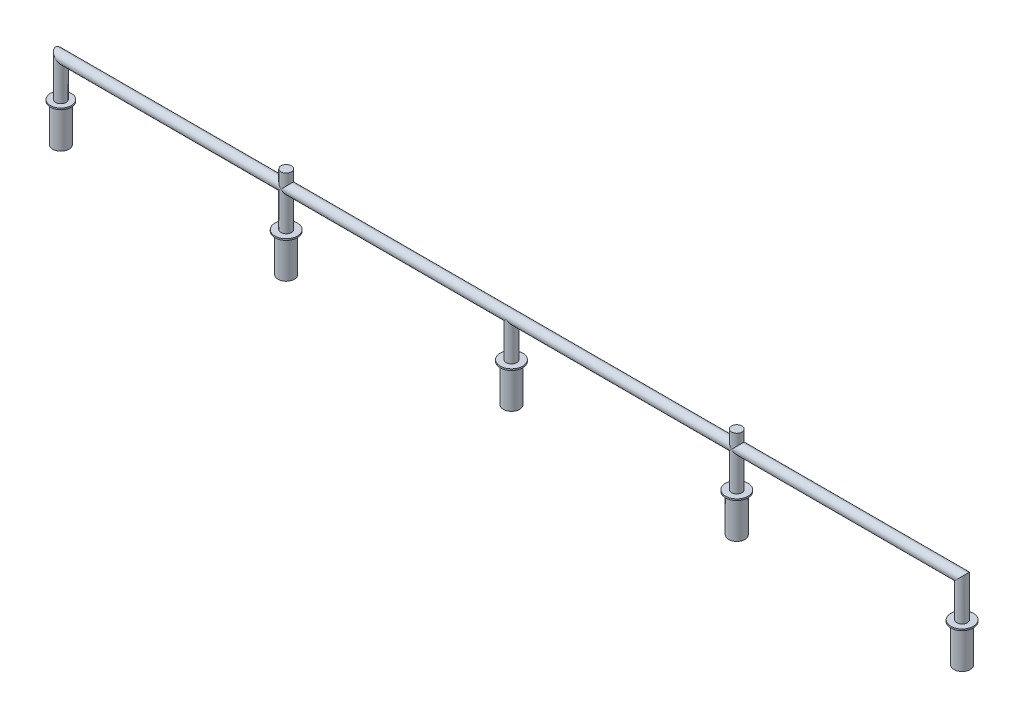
ISO-10303-21;
HEADER;
FILE_DESCRIPTION(('STEP AP214'),'2;1');
FILE_NAME('part.step','',(''),(''),'','','');
FILE_SCHEMA(('AUTOMOTIVE_DESIGN { 1 0 10303 214 1 1 1 1 }'));
ENDSEC;
DATA;
#1=APPLICATION_CONTEXT('core data for automotive mechanical design processes');
#2=APPLICATION_PROTOCOL_DEFINITION('international standard','automotive_design',2000,#1);
#3=PRODUCT_CONTEXT('',#1,'mechanical');
#4=PRODUCT('Part','Part','',(#3));
#5=PRODUCT_RELATED_PRODUCT_CATEGORY('part','',(#4));
#6=PRODUCT_DEFINITION_FORMATION('','',#4);
#7=PRODUCT_DEFINITION_CONTEXT('part definition',#1,'design');
#8=PRODUCT_DEFINITION('design','',#6,#7);
#9=PRODUCT_DEFINITION_SHAPE('','',#8);
#10=(LENGTH_UNIT() NAMED_UNIT(*) SI_UNIT(.MILLI.,.METRE.));
#11=(NAMED_UNIT(*) PLANE_ANGLE_UNIT() SI_UNIT($,.RADIAN.));
#12=(NAMED_UNIT(*) SI_UNIT($,.STERADIAN.) SOLID_ANGLE_UNIT());
#13=UNCERTAINTY_MEASURE_WITH_UNIT(LENGTH_MEASURE(1.E-05),#10,'distance_accuracy_value','');
#14=(GEOMETRIC_REPRESENTATION_CONTEXT(3) GLOBAL_UNCERTAINTY_ASSIGNED_CONTEXT((#13)) GLOBAL_UNIT_ASSIGNED_CONTEXT((#10,
#11,#12)) REPRESENTATION_CONTEXT('',''));
#15=CARTESIAN_POINT('',(0.,0.,0.));
#16=DIRECTION('',(0.,0.,1.));
#17=DIRECTION('',(1.,0.,0.));
#18=AXIS2_PLACEMENT_3D('',#15,#16,#17);
#19=CARTESIAN_POINT('',(600.,-102.,0.));
#20=DIRECTION('',(0.,1.,0.));
#21=DIRECTION('',(-1.,0.,0.));
#22=AXIS2_PLACEMENT_3D('',#19,#20,#21);
#23=CYLINDRICAL_SURFACE('',#22,10.8625225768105);
#24=CARTESIAN_POINT('',(600.,-102.,0.));
#25=DIRECTION('',(0.,-1.,0.));
#26=DIRECTION('',(1.,0.,0.));
#27=AXIS2_PLACEMENT_3D('',#24,#25,#26);
#28=CIRCLE('',#27,10.8625225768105);
#29=CARTESIAN_POINT('',(610.862522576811,-102.,0.));
#30=VERTEX_POINT('',#29);
#31=EDGE_CURVE('E12',#30,#30,#28,.T.);
#32=ORIENTED_EDGE('',*,*,#31,.F.);
#33=EDGE_LOOP('',(#32));
#34=FACE_BOUND('',#33,.T.);
#35=CARTESIAN_POINT('',(600.,-52.,0.));
#36=DIRECTION('',(0.,-1.,0.));
#37=DIRECTION('',(1.,0.,0.));
#38=AXIS2_PLACEMENT_3D('',#35,#36,#37);
#39=CIRCLE('',#38,10.8625225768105);
#40=CARTESIAN_POINT('',(610.862522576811,-52.,0.));
#41=VERTEX_POINT('',#40);
#42=EDGE_CURVE('E79',#41,#41,#39,.T.);
#43=ORIENTED_EDGE('',*,*,#42,.T.);
#44=EDGE_LOOP('',(#43));
#45=FACE_BOUND('',#44,.T.);
#46=ADVANCED_FACE('F76',(#34,#45),#23,.T.);
#47=CARTESIAN_POINT('',(600.,-102.,0.));
#48=DIRECTION('',(0.,-1.,0.));
#49=DIRECTION('',(1.,0.,0.));
#50=AXIS2_PLACEMENT_3D('',#47,#48,#49);
#51=PLANE('',#50);
#52=ORIENTED_EDGE('',*,*,#31,.T.);
#53=EDGE_LOOP('',(#52));
#54=FACE_BOUND('',#53,.T.);
#55=ADVANCED_FACE('F91',(#54),#51,.T.);
#56=CARTESIAN_POINT('',(600.,-52.,0.));
#57=DIRECTION('',(0.,-1.,0.));
#58=DIRECTION('',(1.,0.,0.));
#59=AXIS2_PLACEMENT_3D('',#56,#57,#58);
#60=PLANE('',#59);
#61=ORIENTED_EDGE('',*,*,#42,.F.);
#62=EDGE_LOOP('',(#61));
#63=FACE_BOUND('',#62,.T.);
#64=ADVANCED_FACE('F89',(#63),#60,.F.);
#65=CLOSED_SHELL('',(#46,#55,#64));
#66=MANIFOLD_SOLID_BREP('B2',#65);
#67=CARTESIAN_POINT('',(300.,-102.,0.));
#68=DIRECTION('',(0.,1.,0.));
#69=DIRECTION('',(-1.,0.,0.));
#70=AXIS2_PLACEMENT_3D('',#67,#68,#69);
#71=CYLINDRICAL_SURFACE('',#70,10.8625225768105);
#72=CARTESIAN_POINT('',(300.,-102.,0.));
#73=DIRECTION('',(0.,-1.,0.));
#74=DIRECTION('',(1.,0.,0.));
#75=AXIS2_PLACEMENT_3D('',#72,#73,#74);
#76=CIRCLE('',#75,10.8625225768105);
#77=CARTESIAN_POINT('',(310.862522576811,-102.,0.));
#78=VERTEX_POINT('',#77);
#79=EDGE_CURVE('E75',#78,#78,#76,.T.);
#80=ORIENTED_EDGE('',*,*,#79,.F.);
#81=EDGE_LOOP('',(#80));
#82=FACE_BOUND('',#81,.T.);
#83=CARTESIAN_POINT('',(300.,-52.,0.));
#84=DIRECTION('',(0.,-1.,0.));
#85=DIRECTION('',(1.,0.,0.));
#86=AXIS2_PLACEMENT_3D('',#83,#84,#85);
#87=CIRCLE('',#86,10.8625225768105);
#88=CARTESIAN_POINT('',(310.862522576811,-52.,0.));
#89=VERTEX_POINT('',#88);
#90=EDGE_CURVE('E128',#89,#89,#87,.T.);
#91=ORIENTED_EDGE('',*,*,#90,.T.);
#92=EDGE_LOOP('',(#91));
#93=FACE_BOUND('',#92,.T.);
#94=ADVANCED_FACE('F125',(#82,#93),#71,.T.);
#95=CARTESIAN_POINT('',(300.,-102.,0.));
#96=DIRECTION('',(0.,-1.,0.));
#97=DIRECTION('',(1.,0.,0.));
#98=AXIS2_PLACEMENT_3D('',#95,#96,#97);
#99=PLANE('',#98);
#100=ORIENTED_EDGE('',*,*,#79,.T.);
#101=EDGE_LOOP('',(#100));
#102=FACE_BOUND('',#101,.T.);
#103=ADVANCED_FACE('F140',(#102),#99,.T.);
#104=CARTESIAN_POINT('',(300.,-52.,0.));
#105=DIRECTION('',(0.,-1.,0.));
#106=DIRECTION('',(1.,0.,0.));
#107=AXIS2_PLACEMENT_3D('',#104,#105,#106);
#108=PLANE('',#107);
#109=ORIENTED_EDGE('',*,*,#90,.F.);
#110=EDGE_LOOP('',(#109));
#111=FACE_BOUND('',#110,.T.);
#112=ADVANCED_FACE('F138',(#111),#108,.F.);
#113=CLOSED_SHELL('',(#94,#103,#112));
#114=MANIFOLD_SOLID_BREP('B7',#113);
#115=CARTESIAN_POINT('',(1.11022302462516E-13,-102.,0.));
#116=DIRECTION('',(0.,1.,0.));
#117=DIRECTION('',(-1.,0.,0.));
#118=AXIS2_PLACEMENT_3D('',#115,#116,#117);
#119=CYLINDRICAL_SURFACE('',#118,10.8625225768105);
#120=CARTESIAN_POINT('',(1.11022302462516E-13,-102.,0.));
#121=DIRECTION('',(0.,-1.,0.));
#122=DIRECTION('',(1.,0.,0.));
#123=AXIS2_PLACEMENT_3D('',#120,#121,#122);
#124=CIRCLE('',#123,10.8625225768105);
#125=CARTESIAN_POINT('',(10.8625225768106,-102.,0.));
#126=VERTEX_POINT('',#125);
#127=EDGE_CURVE('E124',#126,#126,#124,.T.);
#128=ORIENTED_EDGE('',*,*,#127,.F.);
#129=EDGE_LOOP('',(#128));
#130=FACE_BOUND('',#129,.T.);
#131=CARTESIAN_POINT('',(1.11022302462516E-13,-52.,0.));
#132=DIRECTION('',(0.,-1.,0.));
#133=DIRECTION('',(1.,0.,0.));
#134=AXIS2_PLACEMENT_3D('',#131,#132,#133);
#135=CIRCLE('',#134,10.8625225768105);
#136=CARTESIAN_POINT('',(10.8625225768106,-52.,0.));
#137=VERTEX_POINT('',#136);
#138=EDGE_CURVE('E177',#137,#137,#135,.T.);
#139=ORIENTED_EDGE('',*,*,#138,.T.);
#140=EDGE_LOOP('',(#139));
#141=FACE_BOUND('',#140,.T.);
#142=ADVANCED_FACE('F174',(#130,#141),#119,.T.);
#143=CARTESIAN_POINT('',(1.11022302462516E-13,-102.,0.));
#144=DIRECTION('',(0.,-1.,0.));
#145=DIRECTION('',(1.,0.,0.));
#146=AXIS2_PLACEMENT_3D('',#143,#144,#145);
#147=PLANE('',#146);
#148=ORIENTED_EDGE('',*,*,#127,.T.);
#149=EDGE_LOOP('',(#148));
#150=FACE_BOUND('',#149,.T.);
#151=ADVANCED_FACE('F189',(#150),#147,.T.);
#152=CARTESIAN_POINT('',(1.11022302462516E-13,-52.,0.));
#153=DIRECTION('',(0.,-1.,0.));
#154=DIRECTION('',(1.,0.,0.));
#155=AXIS2_PLACEMENT_3D('',#152,#153,#154);
#156=PLANE('',#155);
#157=ORIENTED_EDGE('',*,*,#138,.F.);
#158=EDGE_LOOP('',(#157));
#159=FACE_BOUND('',#158,.T.);
#160=ADVANCED_FACE('F187',(#159),#156,.F.);
#161=CLOSED_SHELL('',(#142,#151,#160));
#162=MANIFOLD_SOLID_BREP('B70',#161);
#163=CARTESIAN_POINT('',(-300.,-102.,0.));
#164=DIRECTION('',(0.,1.,0.));
#165=DIRECTION('',(-1.,0.,0.));
#166=AXIS2_PLACEMENT_3D('',#163,#164,#165);
#167=CYLINDRICAL_SURFACE('',#166,10.8625225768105);
#168=CARTESIAN_POINT('',(-300.,-102.,0.));
#169=DIRECTION('',(0.,-1.,0.));
#170=DIRECTION('',(1.,0.,0.));
#171=AXIS2_PLACEMENT_3D('',#168,#169,#170);
#172=CIRCLE('',#171,10.8625225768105);
#173=CARTESIAN_POINT('',(-289.137477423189,-102.,0.));
#174=VERTEX_POINT('',#173);
#175=EDGE_CURVE('E173',#174,#174,#172,.T.);
#176=ORIENTED_EDGE('',*,*,#175,.F.);
#177=EDGE_LOOP('',(#176));
#178=FACE_BOUND('',#177,.T.);
#179=CARTESIAN_POINT('',(-300.,-52.,0.));
#180=DIRECTION('',(0.,-1.,0.));
#181=DIRECTION('',(1.,0.,0.));
#182=AXIS2_PLACEMENT_3D('',#179,#180,#181);
#183=CIRCLE('',#182,10.8625225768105);
#184=CARTESIAN_POINT('',(-289.137477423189,-52.,0.));
#185=VERTEX_POINT('',#184);
#186=EDGE_CURVE('E226',#185,#185,#183,.T.);
#187=ORIENTED_EDGE('',*,*,#186,.T.);
#188=EDGE_LOOP('',(#187));
#189=FACE_BOUND('',#188,.T.);
#190=ADVANCED_FACE('F223',(#178,#189),#167,.T.);
#191=CARTESIAN_POINT('',(-300.,-102.,0.));
#192=DIRECTION('',(0.,-1.,0.));
#193=DIRECTION('',(1.,0.,0.));
#194=AXIS2_PLACEMENT_3D('',#191,#192,#193);
#195=PLANE('',#194);
#196=ORIENTED_EDGE('',*,*,#175,.T.);
#197=EDGE_LOOP('',(#196));
#198=FACE_BOUND('',#197,.T.);
#199=ADVANCED_FACE('F238',(#198),#195,.T.);
#200=CARTESIAN_POINT('',(-300.,-52.,0.));
#201=DIRECTION('',(0.,-1.,0.));
#202=DIRECTION('',(1.,0.,0.));
#203=AXIS2_PLACEMENT_3D('',#200,#201,#202);
#204=PLANE('',#203);
#205=ORIENTED_EDGE('',*,*,#186,.F.);
#206=EDGE_LOOP('',(#205));
#207=FACE_BOUND('',#206,.T.);
#208=ADVANCED_FACE('F236',(#207),#204,.F.);
#209=CLOSED_SHELL('',(#190,#199,#208));
#210=MANIFOLD_SOLID_BREP('B119',#209);
#211=CARTESIAN_POINT('',(-600.,-102.,0.));
#212=DIRECTION('',(0.,1.,0.));
#213=DIRECTION('',(-1.,0.,0.));
#214=AXIS2_PLACEMENT_3D('',#211,#212,#213);
#215=CYLINDRICAL_SURFACE('',#214,10.8625225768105);
#216=CARTESIAN_POINT('',(-600.,-102.,0.));
#217=DIRECTION('',(0.,-1.,0.));
#218=DIRECTION('',(1.,0.,0.));
#219=AXIS2_PLACEMENT_3D('',#216,#217,#218);
#220=CIRCLE('',#219,10.8625225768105);
#221=CARTESIAN_POINT('',(-589.137477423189,-102.,0.));
#222=VERTEX_POINT('',#221);
#223=EDGE_CURVE('E222',#222,#222,#220,.T.);
#224=ORIENTED_EDGE('',*,*,#223,.F.);
#225=EDGE_LOOP('',(#224));
#226=FACE_BOUND('',#225,.T.);
#227=CARTESIAN_POINT('',(-600.,-52.,0.));
#228=DIRECTION('',(0.,-1.,0.));
#229=DIRECTION('',(1.,0.,0.));
#230=AXIS2_PLACEMENT_3D('',#227,#228,#229);
#231=CIRCLE('',#230,10.8625225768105);
#232=CARTESIAN_POINT('',(-589.137477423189,-52.,0.));
#233=VERTEX_POINT('',#232);
#234=EDGE_CURVE('E276',#233,#233,#231,.T.);
#235=ORIENTED_EDGE('',*,*,#234,.T.);
#236=EDGE_LOOP('',(#235));
#237=FACE_BOUND('',#236,.T.);
#238=ADVANCED_FACE('F273',(#226,#237),#215,.T.);
#239=CARTESIAN_POINT('',(-600.,-102.,0.));
#240=DIRECTION('',(0.,-1.,0.));
#241=DIRECTION('',(1.,0.,0.));
#242=AXIS2_PLACEMENT_3D('',#239,#240,#241);
#243=PLANE('',#242);
#244=ORIENTED_EDGE('',*,*,#223,.T.);
#245=EDGE_LOOP('',(#244));
#246=FACE_BOUND('',#245,.T.);
#247=ADVANCED_FACE('F288',(#246),#243,.T.);
#248=CARTESIAN_POINT('',(-600.,-52.,0.));
#249=DIRECTION('',(0.,-1.,0.));
#250=DIRECTION('',(1.,0.,0.));
#251=AXIS2_PLACEMENT_3D('',#248,#249,#250);
#252=PLANE('',#251);
#253=ORIENTED_EDGE('',*,*,#234,.F.);
#254=EDGE_LOOP('',(#253));
#255=FACE_BOUND('',#254,.T.);
#256=ADVANCED_FACE('F286',(#255),#252,.F.);
#257=CLOSED_SHELL('',(#238,#247,#256));
#258=MANIFOLD_SOLID_BREP('B168',#257);
#259=CARTESIAN_POINT('',(600.,15.5,0.));
#260=DIRECTION('',(0.,-1.,0.));
#261=DIRECTION('',(0.,0.,-1.));
#262=AXIS2_PLACEMENT_3D('',#259,#260,#261);
#263=CYLINDRICAL_SURFACE('',#262,7.00000000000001);
#264=CARTESIAN_POINT('',(600.,0.,0.));
#265=DIRECTION('',(0.707106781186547,-0.707106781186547,0.));
#266=DIRECTION('',(0.707106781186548,0.707106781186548,0.));
#267=AXIS2_PLACEMENT_3D('',#264,#265,#266);
#268=ELLIPSE('',#267,9.89949493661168,7.00000000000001);
#269=CARTESIAN_POINT('',(607.,7.00000000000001,0.));
#270=VERTEX_POINT('',#269);
#271=EDGE_CURVE('E395',#270,#270,#268,.T.);
#272=ORIENTED_EDGE('',*,*,#271,.T.);
#273=EDGE_LOOP('',(#272));
#274=FACE_BOUND('',#273,.T.);
#275=CARTESIAN_POINT('',(600.,-50.0000000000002,0.));
#276=DIRECTION('',(0.,-1.,0.));
#277=DIRECTION('',(1.,0.,0.));
#278=AXIS2_PLACEMENT_3D('',#275,#276,#277);
#279=CIRCLE('',#278,7.00000000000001);
#280=CARTESIAN_POINT('',(607.,-50.0000000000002,0.));
#281=VERTEX_POINT('',#280);
#282=EDGE_CURVE('E271',#281,#281,#279,.T.);
#283=ORIENTED_EDGE('',*,*,#282,.F.);
#284=EDGE_LOOP('',(#283));
#285=FACE_BOUND('',#284,.T.);
#286=ADVANCED_FACE('F314',(#274,#285),#263,.T.);
#287=CARTESIAN_POINT('',(300.,0.,0.));
#288=DIRECTION('',(0.,-1.,0.));
#289=DIRECTION('',(0.,0.,-1.));
#290=AXIS2_PLACEMENT_3D('',#287,#288,#289);
#291=CYLINDRICAL_SURFACE('',#290,7.00000000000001);
#292=CARTESIAN_POINT('',(300.,0.,0.));
#293=DIRECTION('',(0.707106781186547,-0.707106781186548,0.));
#294=DIRECTION('',(0.707106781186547,0.707106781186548,0.));
#295=AXIS2_PLACEMENT_3D('',#292,#293,#294);
#296=ELLIPSE('',#295,9.89949493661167,7.00000000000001);
#297=CARTESIAN_POINT('',(300.,0.,-7.00000000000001));
#298=VERTEX_POINT('',#297);
#299=CARTESIAN_POINT('',(300.,0.,7.00000000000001));
#300=VERTEX_POINT('',#299);
#301=EDGE_CURVE('E413',#298,#300,#296,.F.);
#302=ORIENTED_EDGE('',*,*,#301,.F.);
#303=CARTESIAN_POINT('',(300.,0.,0.));
#304=DIRECTION('',(0.707106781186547,0.707106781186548,0.));
#305=DIRECTION('',(0.707106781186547,-0.707106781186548,0.));
#306=AXIS2_PLACEMENT_3D('',#303,#304,#305);
#307=ELLIPSE('',#306,9.89949493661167,7.00000000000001);
#308=EDGE_CURVE('E410',#300,#298,#307,.T.);
#309=ORIENTED_EDGE('',*,*,#308,.F.);
#310=EDGE_LOOP('',(#302,#309));
#311=FACE_BOUND('',#310,.T.);
#312=CARTESIAN_POINT('',(300.,-50.0000000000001,0.));
#313=DIRECTION('',(0.,-1.,0.));
#314=DIRECTION('',(1.,0.,0.));
#315=AXIS2_PLACEMENT_3D('',#312,#313,#314);
#316=CIRCLE('',#315,7.00000000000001);
#317=CARTESIAN_POINT('',(307.,-50.0000000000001,0.));
#318=VERTEX_POINT('',#317);
#319=EDGE_CURVE('E443',#318,#318,#316,.F.);
#320=ORIENTED_EDGE('',*,*,#319,.T.);
#321=EDGE_LOOP('',(#320));
#322=FACE_BOUND('',#321,.T.);
#323=ADVANCED_FACE('F460',(#311,#322),#291,.T.);
#324=CARTESIAN_POINT('',(0.,-100.,0.));
#325=DIRECTION('',(0.,1.,0.));
#326=DIRECTION('',(0.,0.,1.));
#327=AXIS2_PLACEMENT_3D('',#324,#325,#326);
#328=CYLINDRICAL_SURFACE('',#327,7.);
#329=CARTESIAN_POINT('',(0.,0.,0.));
#330=DIRECTION('',(0.707106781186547,0.707106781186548,0.));
#331=DIRECTION('',(0.707106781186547,-0.707106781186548,0.));
#332=AXIS2_PLACEMENT_3D('',#329,#330,#331);
#333=ELLIPSE('',#332,9.89949493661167,7.);
#334=CARTESIAN_POINT('',(0.,0.,7.));
#335=VERTEX_POINT('',#334);
#336=CARTESIAN_POINT('',(0.,0.,-7.));
#337=VERTEX_POINT('',#336);
#338=EDGE_CURVE('E329',#335,#337,#333,.T.);
#339=ORIENTED_EDGE('',*,*,#338,.F.);
#340=CARTESIAN_POINT('',(0.,0.,0.));
#341=DIRECTION('',(0.707106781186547,-0.707106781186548,0.));
#342=DIRECTION('',(0.707106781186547,0.707106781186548,0.));
#343=AXIS2_PLACEMENT_3D('',#340,#341,#342);
#344=ELLIPSE('',#343,9.89949493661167,7.);
#345=EDGE_CURVE('E407',#337,#335,#344,.F.);
#346=ORIENTED_EDGE('',*,*,#345,.F.);
#347=EDGE_LOOP('',(#339,#346));
#348=FACE_BOUND('',#347,.T.);
#349=CARTESIAN_POINT('',(0.,-50.0000000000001,0.));
#350=DIRECTION('',(0.,-1.,0.));
#351=DIRECTION('',(1.,0.,0.));
#352=AXIS2_PLACEMENT_3D('',#349,#350,#351);
#353=CIRCLE('',#352,7.);
#354=CARTESIAN_POINT('',(7.,-50.0000000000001,0.));
#355=VERTEX_POINT('',#354);
#356=EDGE_CURVE('E436',#355,#355,#353,.F.);
#357=ORIENTED_EDGE('',*,*,#356,.T.);
#358=EDGE_LOOP('',(#357));
#359=FACE_BOUND('',#358,.T.);
#360=ADVANCED_FACE('F478',(#348,#359),#328,.T.);
#361=CARTESIAN_POINT('',(-300.,0.,0.));
#362=DIRECTION('',(0.,-1.,0.));
#363=DIRECTION('',(0.,0.,-1.));
#364=AXIS2_PLACEMENT_3D('',#361,#362,#363);
#365=CYLINDRICAL_SURFACE('',#364,7.00000000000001);
#366=CARTESIAN_POINT('',(-300.,0.,0.));
#367=DIRECTION('',(0.707106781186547,-0.707106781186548,0.));
#368=DIRECTION('',(0.707106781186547,0.707106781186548,0.));
#369=AXIS2_PLACEMENT_3D('',#366,#367,#368);
#370=ELLIPSE('',#369,9.89949493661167,7.00000000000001);
#371=CARTESIAN_POINT('',(-300.,0.,-7.00000000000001));
#372=VERTEX_POINT('',#371);
#373=CARTESIAN_POINT('',(-300.,0.,7.00000000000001));
#374=VERTEX_POINT('',#373);
#375=EDGE_CURVE('E404',#372,#374,#370,.F.);
#376=ORIENTED_EDGE('',*,*,#375,.F.);
#377=CARTESIAN_POINT('',(-300.,0.,0.));
#378=DIRECTION('',(0.707106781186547,0.707106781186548,0.));
#379=DIRECTION('',(0.707106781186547,-0.707106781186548,0.));
#380=AXIS2_PLACEMENT_3D('',#377,#378,#379);
#381=ELLIPSE('',#380,9.89949493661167,7.00000000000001);
#382=EDGE_CURVE('E398',#374,#372,#381,.T.);
#383=ORIENTED_EDGE('',*,*,#382,.F.);
#384=EDGE_LOOP('',(#376,#383));
#385=FACE_BOUND('',#384,.T.);
#386=CARTESIAN_POINT('',(-300.,-50.,0.));
#387=DIRECTION('',(0.,-1.,0.));
#388=DIRECTION('',(1.,0.,0.));
#389=AXIS2_PLACEMENT_3D('',#386,#387,#388);
#390=CIRCLE('',#389,7.00000000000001);
#391=CARTESIAN_POINT('',(-293.,-50.,0.));
#392=VERTEX_POINT('',#391);
#393=EDGE_CURVE('E429',#392,#392,#390,.F.);
#394=ORIENTED_EDGE('',*,*,#393,.T.);
#395=EDGE_LOOP('',(#394));
#396=FACE_BOUND('',#395,.T.);
#397=ADVANCED_FACE('F575',(#385,#396),#365,.T.);
#398=CARTESIAN_POINT('',(-615.5,0.,0.));
#399=DIRECTION('',(1.,0.,0.));
#400=DIRECTION('',(0.,0.,-1.));
#401=AXIS2_PLACEMENT_3D('',#398,#399,#400);
#402=CYLINDRICAL_SURFACE('',#401,7.00000000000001);
#403=ORIENTED_EDGE('',*,*,#382,.T.);
#404=CARTESIAN_POINT('',(-300.,0.,0.));
#405=DIRECTION('',(0.707106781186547,-0.707106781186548,0.));
#406=DIRECTION('',(0.707106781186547,0.707106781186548,0.));
#407=AXIS2_PLACEMENT_3D('',#404,#405,#406);
#408=ELLIPSE('',#407,9.89949493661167,7.00000000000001);
#409=EDGE_CURVE('E416',#372,#374,#408,.T.);
#410=ORIENTED_EDGE('',*,*,#409,.T.);
#411=EDGE_LOOP('',(#403,#410));
#412=FACE_BOUND('',#411,.T.);
#413=ORIENTED_EDGE('',*,*,#345,.T.);
#414=ORIENTED_EDGE('',*,*,#338,.T.);
#415=EDGE_LOOP('',(#413,#414));
#416=FACE_BOUND('',#415,.T.);
#417=ORIENTED_EDGE('',*,*,#301,.T.);
#418=CARTESIAN_POINT('',(300.,0.,0.));
#419=DIRECTION('',(0.707106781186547,0.707106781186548,0.));
#420=DIRECTION('',(0.707106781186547,-0.707106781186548,0.));
#421=AXIS2_PLACEMENT_3D('',#418,#419,#420);
#422=ELLIPSE('',#421,9.89949493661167,7.00000000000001);
#423=EDGE_CURVE('E425',#300,#298,#422,.F.);
#424=ORIENTED_EDGE('',*,*,#423,.T.);
#425=EDGE_LOOP('',(#417,#424));
#426=FACE_BOUND('',#425,.T.);
#427=ADVANCED_FACE('F572',(#412,#416,#426),#402,.T.);
#428=CARTESIAN_POINT('',(-600.,-1.04083408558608E-13,0.));
#429=DIRECTION('',(0.707106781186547,0.707106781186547,0.));
#430=DIRECTION('',(-0.707106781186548,0.707106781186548,0.));
#431=AXIS2_PLACEMENT_3D('',#428,#429,#430);
#432=ELLIPSE('',#431,9.89949493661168,7.00000000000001);
#433=CARTESIAN_POINT('',(-607.,6.9999999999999,0.));
#434=VERTEX_POINT('',#433);
#435=EDGE_CURVE('E394',#434,#434,#432,.T.);
#436=ORIENTED_EDGE('',*,*,#435,.T.);
#437=EDGE_LOOP('',(#436));
#438=FACE_BOUND('',#437,.T.);
#439=ORIENTED_EDGE('',*,*,#375,.T.);
#440=CARTESIAN_POINT('',(-300.,0.,0.));
#441=DIRECTION('',(0.707106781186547,0.707106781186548,0.));
#442=DIRECTION('',(0.707106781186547,-0.707106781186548,0.));
#443=AXIS2_PLACEMENT_3D('',#440,#441,#442);
#444=ELLIPSE('',#443,9.89949493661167,7.00000000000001);
#445=EDGE_CURVE('E419',#374,#372,#444,.F.);
#446=ORIENTED_EDGE('',*,*,#445,.T.);
#447=EDGE_LOOP('',(#439,#446));
#448=FACE_BOUND('',#447,.T.);
#449=ADVANCED_FACE('F577',(#438,#448),#402,.T.);
#450=ORIENTED_EDGE('',*,*,#308,.T.);
#451=CARTESIAN_POINT('',(300.,0.,0.));
#452=DIRECTION('',(0.707106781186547,-0.707106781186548,0.));
#453=DIRECTION('',(0.707106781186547,0.707106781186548,0.));
#454=AXIS2_PLACEMENT_3D('',#451,#452,#453);
#455=ELLIPSE('',#454,9.89949493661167,7.00000000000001);
#456=EDGE_CURVE('E422',#298,#300,#455,.T.);
#457=ORIENTED_EDGE('',*,*,#456,.T.);
#458=EDGE_LOOP('',(#450,#457));
#459=FACE_BOUND('',#458,.T.);
#460=ORIENTED_EDGE('',*,*,#271,.F.);
#461=EDGE_LOOP('',(#460));
#462=FACE_BOUND('',#461,.T.);
#463=ADVANCED_FACE('F561',(#459,#462),#402,.T.);
#464=CARTESIAN_POINT('',(-600.,-50.,0.));
#465=DIRECTION('',(0.,1.,0.));
#466=DIRECTION('',(0.,0.,1.));
#467=AXIS2_PLACEMENT_3D('',#464,#465,#466);
#468=CYLINDRICAL_SURFACE('',#467,7.00000000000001);
#469=CARTESIAN_POINT('',(-600.,-50.,0.));
#470=DIRECTION('',(0.,-1.,0.));
#471=DIRECTION('',(0.,0.,1.));
#472=AXIS2_PLACEMENT_3D('',#469,#470,#471);
#473=CIRCLE('',#472,7.00000000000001);
#474=CARTESIAN_POINT('',(-600.,-50.,7.00000000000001));
#475=VERTEX_POINT('',#474);
#476=EDGE_CURVE('E391',#475,#475,#473,.T.);
#477=ORIENTED_EDGE('',*,*,#476,.F.);
#478=EDGE_LOOP('',(#477));
#479=FACE_BOUND('',#478,.T.);
#480=ORIENTED_EDGE('',*,*,#435,.F.);
#481=EDGE_LOOP('',(#480));
#482=FACE_BOUND('',#481,.T.);
#483=ADVANCED_FACE('F559',(#479,#482),#468,.T.);
#484=CARTESIAN_POINT('',(-300.,0.,0.));
#485=DIRECTION('',(0.,1.,0.));
#486=DIRECTION('',(0.,0.,1.));
#487=AXIS2_PLACEMENT_3D('',#484,#485,#486);
#488=CYLINDRICAL_SURFACE('',#487,7.00000000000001);
#489=CARTESIAN_POINT('',(-300.,20.,0.));
#490=DIRECTION('',(0.,1.,0.));
#491=DIRECTION('',(0.,0.,1.));
#492=AXIS2_PLACEMENT_3D('',#489,#490,#491);
#493=CIRCLE('',#492,7.00000000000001);
#494=CARTESIAN_POINT('',(-300.,20.,7.00000000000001));
#495=VERTEX_POINT('',#494);
#496=EDGE_CURVE('E375',#495,#495,#493,.T.);
#497=ORIENTED_EDGE('',*,*,#496,.F.);
#498=EDGE_LOOP('',(#497));
#499=FACE_BOUND('',#498,.T.);
#500=ORIENTED_EDGE('',*,*,#445,.F.);
#501=ORIENTED_EDGE('',*,*,#409,.F.);
#502=EDGE_LOOP('',(#500,#501));
#503=FACE_BOUND('',#502,.T.);
#504=ADVANCED_FACE('F556',(#499,#503),#488,.T.);
#505=CARTESIAN_POINT('',(-300.,20.,0.));
#506=DIRECTION('',(0.,1.,0.));
#507=DIRECTION('',(0.,0.,1.));
#508=AXIS2_PLACEMENT_3D('',#505,#506,#507);
#509=PLANE('',#508);
#510=ORIENTED_EDGE('',*,*,#496,.T.);
#511=EDGE_LOOP('',(#510));
#512=FACE_BOUND('',#511,.T.);
#513=ADVANCED_FACE('F553',(#512),#509,.T.);
#514=CARTESIAN_POINT('',(300.,0.,0.));
#515=DIRECTION('',(0.,1.,0.));
#516=DIRECTION('',(0.,0.,1.));
#517=AXIS2_PLACEMENT_3D('',#514,#515,#516);
#518=CYLINDRICAL_SURFACE('',#517,7.00000000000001);
#519=CARTESIAN_POINT('',(300.,20.,0.));
#520=DIRECTION('',(0.,1.,0.));
#521=DIRECTION('',(0.,0.,1.));
#522=AXIS2_PLACEMENT_3D('',#519,#520,#521);
#523=CIRCLE('',#522,7.00000000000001);
#524=CARTESIAN_POINT('',(300.,20.,7.00000000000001));
#525=VERTEX_POINT('',#524);
#526=EDGE_CURVE('E372',#525,#525,#523,.T.);
#527=ORIENTED_EDGE('',*,*,#526,.F.);
#528=EDGE_LOOP('',(#527));
#529=FACE_BOUND('',#528,.T.);
#530=ORIENTED_EDGE('',*,*,#423,.F.);
#531=ORIENTED_EDGE('',*,*,#456,.F.);
#532=EDGE_LOOP('',(#530,#531));
#533=FACE_BOUND('',#532,.T.);
#534=ADVANCED_FACE('F550',(#529,#533),#518,.T.);
#535=CARTESIAN_POINT('',(300.,20.,0.));
#536=DIRECTION('',(0.,1.,0.));
#537=DIRECTION('',(0.,0.,1.));
#538=AXIS2_PLACEMENT_3D('',#535,#536,#537);
#539=PLANE('',#538);
#540=ORIENTED_EDGE('',*,*,#526,.T.);
#541=EDGE_LOOP('',(#540));
#542=FACE_BOUND('',#541,.T.);
#543=ADVANCED_FACE('F373',(#542),#539,.T.);
#544=CARTESIAN_POINT('',(-600.,-52.,0.));
#545=DIRECTION('',(0.,1.,0.));
#546=DIRECTION('',(-1.,0.,0.));
#547=AXIS2_PLACEMENT_3D('',#544,#545,#546);
#548=CYLINDRICAL_SURFACE('',#547,14.);
#549=CARTESIAN_POINT('',(-600.,-52.,0.));
#550=DIRECTION('',(0.,-1.,0.));
#551=DIRECTION('',(1.,0.,0.));
#552=AXIS2_PLACEMENT_3D('',#549,#550,#551);
#553=CIRCLE('',#552,14.);
#554=CARTESIAN_POINT('',(-586.,-52.,0.));
#555=VERTEX_POINT('',#554);
#556=EDGE_CURVE('E376',#555,#555,#553,.T.);
#557=ORIENTED_EDGE('',*,*,#556,.F.);
#558=EDGE_LOOP('',(#557));
#559=FACE_BOUND('',#558,.T.);
#560=CARTESIAN_POINT('',(-600.,-50.,0.));
#561=DIRECTION('',(0.,-1.,0.));
#562=DIRECTION('',(1.,0.,0.));
#563=AXIS2_PLACEMENT_3D('',#560,#561,#562);
#564=CIRCLE('',#563,14.);
#565=CARTESIAN_POINT('',(-586.,-50.,0.));
#566=VERTEX_POINT('',#565);
#567=EDGE_CURVE('E381',#566,#566,#564,.T.);
#568=ORIENTED_EDGE('',*,*,#567,.T.);
#569=EDGE_LOOP('',(#568));
#570=FACE_BOUND('',#569,.T.);
#571=ADVANCED_FACE('F542',(#559,#570),#548,.T.);
#572=CARTESIAN_POINT('',(-600.,-52.,0.));
#573=DIRECTION('',(0.,-1.,0.));
#574=DIRECTION('',(1.,0.,0.));
#575=AXIS2_PLACEMENT_3D('',#572,#573,#574);
#576=PLANE('',#575);
#577=ORIENTED_EDGE('',*,*,#556,.T.);
#578=EDGE_LOOP('',(#577));
#579=FACE_BOUND('',#578,.T.);
#580=ADVANCED_FACE('F539',(#579),#576,.T.);
#581=CARTESIAN_POINT('',(-600.,-50.,0.));
#582=DIRECTION('',(0.,-1.,0.));
#583=DIRECTION('',(1.,0.,0.));
#584=AXIS2_PLACEMENT_3D('',#581,#582,#583);
#585=PLANE('',#584);
#586=ORIENTED_EDGE('',*,*,#476,.T.);
#587=EDGE_LOOP('',(#586));
#588=FACE_BOUND('',#587,.T.);
#589=ORIENTED_EDGE('',*,*,#567,.F.);
#590=EDGE_LOOP('',(#589));
#591=FACE_BOUND('',#590,.T.);
#592=ADVANCED_FACE('F537',(#588,#591),#585,.F.);
#593=CARTESIAN_POINT('',(-300.,-52.,0.));
#594=DIRECTION('',(0.,1.,0.));
#595=DIRECTION('',(-1.,0.,0.));
#596=AXIS2_PLACEMENT_3D('',#593,#594,#595);
#597=CYLINDRICAL_SURFACE('',#596,15.);
#598=CARTESIAN_POINT('',(-300.,-52.,0.));
#599=DIRECTION('',(0.,-1.,0.));
#600=DIRECTION('',(1.,0.,0.));
#601=AXIS2_PLACEMENT_3D('',#598,#599,#600);
#602=CIRCLE('',#601,15.);
#603=CARTESIAN_POINT('',(-285.,-52.,0.));
#604=VERTEX_POINT('',#603);
#605=EDGE_CURVE('E432',#604,#604,#602,.T.);
#606=ORIENTED_EDGE('',*,*,#605,.F.);
#607=EDGE_LOOP('',(#606));
#608=FACE_BOUND('',#607,.T.);
#609=CARTESIAN_POINT('',(-300.,-50.,0.));
#610=DIRECTION('',(0.,-1.,0.));
#611=DIRECTION('',(1.,0.,0.));
#612=AXIS2_PLACEMENT_3D('',#609,#610,#611);
#613=CIRCLE('',#612,15.);
#614=CARTESIAN_POINT('',(-285.,-50.,0.));
#615=VERTEX_POINT('',#614);
#616=EDGE_CURVE('E439',#615,#615,#613,.T.);
#617=ORIENTED_EDGE('',*,*,#616,.T.);
#618=EDGE_LOOP('',(#617));
#619=FACE_BOUND('',#618,.T.);
#620=ADVANCED_FACE('F515',(#608,#619),#597,.T.);
#621=CARTESIAN_POINT('',(-300.,-52.,0.));
#622=DIRECTION('',(0.,-1.,0.));
#623=DIRECTION('',(1.,0.,0.));
#624=AXIS2_PLACEMENT_3D('',#621,#622,#623);
#625=PLANE('',#624);
#626=CARTESIAN_POINT('',(-300.,-52.,0.));
#627=DIRECTION('',(0.,-1.,0.));
#628=DIRECTION('',(1.,0.,0.));
#629=AXIS2_PLACEMENT_3D('',#626,#627,#628);
#630=CIRCLE('',#629,7.00000000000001);
#631=CARTESIAN_POINT('',(-293.,-52.,0.));
#632=VERTEX_POINT('',#631);
#633=EDGE_CURVE('E428',#632,#632,#630,.F.);
#634=ORIENTED_EDGE('',*,*,#633,.T.);
#635=EDGE_LOOP('',(#634));
#636=FACE_BOUND('',#635,.T.);
#637=ORIENTED_EDGE('',*,*,#605,.T.);
#638=EDGE_LOOP('',(#637));
#639=FACE_BOUND('',#638,.T.);
#640=ADVANCED_FACE('F520',(#636,#639),#625,.T.);
#641=CARTESIAN_POINT('',(-300.,-50.,0.));
#642=DIRECTION('',(0.,-1.,0.));
#643=DIRECTION('',(1.,0.,0.));
#644=AXIS2_PLACEMENT_3D('',#641,#642,#643);
#645=PLANE('',#644);
#646=ORIENTED_EDGE('',*,*,#393,.F.);
#647=EDGE_LOOP('',(#646));
#648=FACE_BOUND('',#647,.T.);
#649=ORIENTED_EDGE('',*,*,#616,.F.);
#650=EDGE_LOOP('',(#649));
#651=FACE_BOUND('',#650,.T.);
#652=ADVANCED_FACE('F517',(#648,#651),#645,.F.);
#653=CARTESIAN_POINT('',(-300.,-100.,0.));
#654=DIRECTION('',(0.,-1.,0.));
#655=DIRECTION('',(0.,0.,-1.));
#656=AXIS2_PLACEMENT_3D('',#653,#654,#655);
#657=PLANE('',#656);
#658=CARTESIAN_POINT('',(-300.,-100.,0.));
#659=DIRECTION('',(0.,-1.,0.));
#660=DIRECTION('',(0.,0.,-1.));
#661=AXIS2_PLACEMENT_3D('',#658,#659,#660);
#662=CIRCLE('',#661,7.00000000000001);
#663=CARTESIAN_POINT('',(-300.,-100.,-7.00000000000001));
#664=VERTEX_POINT('',#663);
#665=EDGE_CURVE('E389',#664,#664,#662,.T.);
#666=ORIENTED_EDGE('',*,*,#665,.T.);
#667=EDGE_LOOP('',(#666));
#668=FACE_BOUND('',#667,.T.);
#669=ADVANCED_FACE('F519',(#668),#657,.T.);
#670=ORIENTED_EDGE('',*,*,#633,.F.);
#671=EDGE_LOOP('',(#670));
#672=FACE_BOUND('',#671,.T.);
#673=ORIENTED_EDGE('',*,*,#665,.F.);
#674=EDGE_LOOP('',(#673));
#675=FACE_BOUND('',#674,.T.);
#676=ADVANCED_FACE('F527',(#672,#675),#365,.T.);
#677=CARTESIAN_POINT('',(0.,-52.0000000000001,0.));
#678=DIRECTION('',(0.,1.,0.));
#679=DIRECTION('',(-1.,0.,0.));
#680=AXIS2_PLACEMENT_3D('',#677,#678,#679);
#681=CYLINDRICAL_SURFACE('',#680,15.);
#682=CARTESIAN_POINT('',(0.,-52.0000000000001,0.));
#683=DIRECTION('',(0.,-1.,0.));
#684=DIRECTION('',(1.,0.,0.));
#685=AXIS2_PLACEMENT_3D('',#682,#683,#684);
#686=CIRCLE('',#685,15.);
#687=CARTESIAN_POINT('',(14.9999999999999,-52.0000000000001,0.));
#688=VERTEX_POINT('',#687);
#689=EDGE_CURVE('E440',#688,#688,#686,.T.);
#690=ORIENTED_EDGE('',*,*,#689,.F.);
#691=EDGE_LOOP('',(#690));
#692=FACE_BOUND('',#691,.T.);
#693=CARTESIAN_POINT('',(0.,-50.0000000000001,0.));
#694=DIRECTION('',(0.,-1.,0.));
#695=DIRECTION('',(1.,0.,0.));
#696=AXIS2_PLACEMENT_3D('',#693,#694,#695);
#697=CIRCLE('',#696,15.);
#698=CARTESIAN_POINT('',(14.9999999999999,-50.0000000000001,0.));
#699=VERTEX_POINT('',#698);
#700=EDGE_CURVE('E446',#699,#699,#697,.T.);
#701=ORIENTED_EDGE('',*,*,#700,.T.);
#702=EDGE_LOOP('',(#701));
#703=FACE_BOUND('',#702,.T.);
#704=ADVANCED_FACE('F595',(#692,#703),#681,.T.);
#705=CARTESIAN_POINT('',(0.,-52.0000000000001,0.));
#706=DIRECTION('',(0.,-1.,0.));
#707=DIRECTION('',(1.,0.,0.));
#708=AXIS2_PLACEMENT_3D('',#705,#706,#707);
#709=PLANE('',#708);
#710=CARTESIAN_POINT('',(0.,-52.0000000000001,0.));
#711=DIRECTION('',(0.,-1.,0.));
#712=DIRECTION('',(1.,0.,0.));
#713=AXIS2_PLACEMENT_3D('',#710,#711,#712);
#714=CIRCLE('',#713,7.);
#715=CARTESIAN_POINT('',(7.,-52.0000000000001,0.));
#716=VERTEX_POINT('',#715);
#717=EDGE_CURVE('E435',#716,#716,#714,.F.);
#718=ORIENTED_EDGE('',*,*,#717,.T.);
#719=EDGE_LOOP('',(#718));
#720=FACE_BOUND('',#719,.T.);
#721=ORIENTED_EDGE('',*,*,#689,.T.);
#722=EDGE_LOOP('',(#721));
#723=FACE_BOUND('',#722,.T.);
#724=ADVANCED_FACE('F621',(#720,#723),#709,.T.);
#725=CARTESIAN_POINT('',(0.,-50.0000000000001,0.));
#726=DIRECTION('',(0.,-1.,0.));
#727=DIRECTION('',(1.,0.,0.));
#728=AXIS2_PLACEMENT_3D('',#725,#726,#727);
#729=PLANE('',#728);
#730=ORIENTED_EDGE('',*,*,#356,.F.);
#731=EDGE_LOOP('',(#730));
#732=FACE_BOUND('',#731,.T.);
#733=ORIENTED_EDGE('',*,*,#700,.F.);
#734=EDGE_LOOP('',(#733));
#735=FACE_BOUND('',#734,.T.);
#736=ADVANCED_FACE('F600',(#732,#735),#729,.F.);
#737=CARTESIAN_POINT('',(0.,-100.,0.));
#738=DIRECTION('',(0.,1.,0.));
#739=DIRECTION('',(0.,0.,1.));
#740=AXIS2_PLACEMENT_3D('',#737,#738,#739);
#741=PLANE('',#740);
#742=CARTESIAN_POINT('',(0.,-100.,0.));
#743=DIRECTION('',(0.,1.,0.));
#744=DIRECTION('',(0.,0.,1.));
#745=AXIS2_PLACEMENT_3D('',#742,#743,#744);
#746=CIRCLE('',#745,7.);
#747=CARTESIAN_POINT('',(0.,-100.,7.));
#748=VERTEX_POINT('',#747);
#749=EDGE_CURVE('E386',#748,#748,#746,.T.);
#750=ORIENTED_EDGE('',*,*,#749,.F.);
#751=EDGE_LOOP('',(#750));
#752=FACE_BOUND('',#751,.T.);
#753=ADVANCED_FACE('F597',(#752),#741,.F.);
#754=ORIENTED_EDGE('',*,*,#717,.F.);
#755=EDGE_LOOP('',(#754));
#756=FACE_BOUND('',#755,.T.);
#757=ORIENTED_EDGE('',*,*,#749,.T.);
#758=EDGE_LOOP('',(#757));
#759=FACE_BOUND('',#758,.T.);
#760=ADVANCED_FACE('F599',(#756,#759),#328,.T.);
#761=CARTESIAN_POINT('',(300.,-52.0000000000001,0.));
#762=DIRECTION('',(0.,1.,0.));
#763=DIRECTION('',(-1.,0.,0.));
#764=AXIS2_PLACEMENT_3D('',#761,#762,#763);
#765=CYLINDRICAL_SURFACE('',#764,15.);
#766=CARTESIAN_POINT('',(300.,-52.0000000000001,0.));
#767=DIRECTION('',(0.,-1.,0.));
#768=DIRECTION('',(1.,0.,0.));
#769=AXIS2_PLACEMENT_3D('',#766,#767,#768);
#770=CIRCLE('',#769,15.);
#771=CARTESIAN_POINT('',(315.,-52.0000000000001,0.));
#772=VERTEX_POINT('',#771);
#773=EDGE_CURVE('E447',#772,#772,#770,.T.);
#774=ORIENTED_EDGE('',*,*,#773,.F.);
#775=EDGE_LOOP('',(#774));
#776=FACE_BOUND('',#775,.T.);
#777=CARTESIAN_POINT('',(300.,-50.0000000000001,0.));
#778=DIRECTION('',(0.,-1.,0.));
#779=DIRECTION('',(1.,0.,0.));
#780=AXIS2_PLACEMENT_3D('',#777,#778,#779);
#781=CIRCLE('',#780,15.);
#782=CARTESIAN_POINT('',(315.,-50.0000000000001,0.));
#783=VERTEX_POINT('',#782);
#784=EDGE_CURVE('E492',#783,#783,#781,.T.);
#785=ORIENTED_EDGE('',*,*,#784,.T.);
#786=EDGE_LOOP('',(#785));
#787=FACE_BOUND('',#786,.T.);
#788=ADVANCED_FACE('F603',(#776,#787),#765,.T.);
#789=CARTESIAN_POINT('',(300.,-52.0000000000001,0.));
#790=DIRECTION('',(0.,-1.,0.));
#791=DIRECTION('',(1.,0.,0.));
#792=AXIS2_PLACEMENT_3D('',#789,#790,#791);
#793=PLANE('',#792);
#794=CARTESIAN_POINT('',(300.,-52.0000000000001,0.));
#795=DIRECTION('',(0.,-1.,0.));
#796=DIRECTION('',(1.,0.,0.));
#797=AXIS2_PLACEMENT_3D('',#794,#795,#796);
#798=CIRCLE('',#797,7.00000000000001);
#799=CARTESIAN_POINT('',(307.,-52.0000000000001,0.));
#800=VERTEX_POINT('',#799);
#801=EDGE_CURVE('E323',#800,#800,#798,.F.);
#802=ORIENTED_EDGE('',*,*,#801,.T.);
#803=EDGE_LOOP('',(#802));
#804=FACE_BOUND('',#803,.T.);
#805=ORIENTED_EDGE('',*,*,#773,.T.);
#806=EDGE_LOOP('',(#805));
#807=FACE_BOUND('',#806,.T.);
#808=ADVANCED_FACE('F451',(#804,#807),#793,.T.);
#809=CARTESIAN_POINT('',(300.,-50.0000000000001,0.));
#810=DIRECTION('',(0.,-1.,0.));
#811=DIRECTION('',(1.,0.,0.));
#812=AXIS2_PLACEMENT_3D('',#809,#810,#811);
#813=PLANE('',#812);
#814=ORIENTED_EDGE('',*,*,#319,.F.);
#815=EDGE_LOOP('',(#814));
#816=FACE_BOUND('',#815,.T.);
#817=ORIENTED_EDGE('',*,*,#784,.F.);
#818=EDGE_LOOP('',(#817));
#819=FACE_BOUND('',#818,.T.);
#820=ADVANCED_FACE('F464',(#816,#819),#813,.F.);
#821=CARTESIAN_POINT('',(300.,-100.,0.));
#822=DIRECTION('',(0.,-1.,0.));
#823=DIRECTION('',(0.,0.,-1.));
#824=AXIS2_PLACEMENT_3D('',#821,#822,#823);
#825=PLANE('',#824);
#826=CARTESIAN_POINT('',(300.,-100.,0.));
#827=DIRECTION('',(0.,-1.,0.));
#828=DIRECTION('',(0.,0.,-1.));
#829=AXIS2_PLACEMENT_3D('',#826,#827,#828);
#830=CIRCLE('',#829,7.00000000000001);
#831=CARTESIAN_POINT('',(300.,-100.,-7.00000000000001));
#832=VERTEX_POINT('',#831);
#833=EDGE_CURVE('E378',#832,#832,#830,.T.);
#834=ORIENTED_EDGE('',*,*,#833,.T.);
#835=EDGE_LOOP('',(#834));
#836=FACE_BOUND('',#835,.T.);
#837=ADVANCED_FACE('F458',(#836),#825,.T.);
#838=ORIENTED_EDGE('',*,*,#801,.F.);
#839=EDGE_LOOP('',(#838));
#840=FACE_BOUND('',#839,.T.);
#841=ORIENTED_EDGE('',*,*,#833,.F.);
#842=EDGE_LOOP('',(#841));
#843=FACE_BOUND('',#842,.T.);
#844=ADVANCED_FACE('F454',(#840,#843),#291,.T.);
#845=CARTESIAN_POINT('',(600.,-52.0000000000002,0.));
#846=DIRECTION('',(0.,1.,0.));
#847=DIRECTION('',(-1.,0.,0.));
#848=AXIS2_PLACEMENT_3D('',#845,#846,#847);
#849=CYLINDRICAL_SURFACE('',#848,15.);
#850=CARTESIAN_POINT('',(600.,-52.0000000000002,0.));
#851=DIRECTION('',(0.,-1.,0.));
#852=DIRECTION('',(1.,0.,0.));
#853=AXIS2_PLACEMENT_3D('',#850,#851,#852);
#854=CIRCLE('',#853,15.);
#855=CARTESIAN_POINT('',(615.,-52.0000000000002,0.));
#856=VERTEX_POINT('',#855);
#857=EDGE_CURVE('E493',#856,#856,#854,.T.);
#858=ORIENTED_EDGE('',*,*,#857,.F.);
#859=EDGE_LOOP('',(#858));
#860=FACE_BOUND('',#859,.T.);
#861=CARTESIAN_POINT('',(600.,-50.0000000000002,0.));
#862=DIRECTION('',(0.,-1.,0.));
#863=DIRECTION('',(1.,0.,0.));
#864=AXIS2_PLACEMENT_3D('',#861,#862,#863);
#865=CIRCLE('',#864,15.);
#866=CARTESIAN_POINT('',(615.,-50.0000000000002,0.));
#867=VERTEX_POINT('',#866);
#868=EDGE_CURVE('E497',#867,#867,#865,.T.);
#869=ORIENTED_EDGE('',*,*,#868,.T.);
#870=EDGE_LOOP('',(#869));
#871=FACE_BOUND('',#870,.T.);
#872=ADVANCED_FACE('F457',(#860,#871),#849,.T.);
#873=CARTESIAN_POINT('',(600.,-52.0000000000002,0.));
#874=DIRECTION('',(0.,-1.,0.));
#875=DIRECTION('',(1.,0.,0.));
#876=AXIS2_PLACEMENT_3D('',#873,#874,#875);
#877=PLANE('',#876);
#878=CARTESIAN_POINT('',(600.,-52.0000000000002,0.));
#879=DIRECTION('',(0.,-1.,0.));
#880=DIRECTION('',(1.,0.,0.));
#881=AXIS2_PLACEMENT_3D('',#878,#879,#880);
#882=CIRCLE('',#881,7.00000000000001);
#883=CARTESIAN_POINT('',(607.,-52.0000000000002,0.));
#884=VERTEX_POINT('',#883);
#885=EDGE_CURVE('E318',#884,#884,#882,.T.);
#886=ORIENTED_EDGE('',*,*,#885,.F.);
#887=EDGE_LOOP('',(#886));
#888=FACE_BOUND('',#887,.T.);
#889=ORIENTED_EDGE('',*,*,#857,.T.);
#890=EDGE_LOOP('',(#889));
#891=FACE_BOUND('',#890,.T.);
#892=ADVANCED_FACE('F638',(#888,#891),#877,.T.);
#893=CARTESIAN_POINT('',(600.,-50.0000000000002,0.));
#894=DIRECTION('',(0.,-1.,0.));
#895=DIRECTION('',(1.,0.,0.));
#896=AXIS2_PLACEMENT_3D('',#893,#894,#895);
#897=PLANE('',#896);
#898=ORIENTED_EDGE('',*,*,#282,.T.);
#899=EDGE_LOOP('',(#898));
#900=FACE_BOUND('',#899,.T.);
#901=ORIENTED_EDGE('',*,*,#868,.F.);
#902=EDGE_LOOP('',(#901));
#903=FACE_BOUND('',#902,.T.);
#904=ADVANCED_FACE('F487',(#900,#903),#897,.F.);
#905=CARTESIAN_POINT('',(600.,-100.,0.));
#906=DIRECTION('',(0.,1.,0.));
#907=DIRECTION('',(0.,0.,1.));
#908=AXIS2_PLACEMENT_3D('',#905,#906,#907);
#909=PLANE('',#908);
#910=CARTESIAN_POINT('',(600.,-100.,0.));
#911=DIRECTION('',(0.,1.,0.));
#912=DIRECTION('',(0.,0.,1.));
#913=AXIS2_PLACEMENT_3D('',#910,#911,#912);
#914=CIRCLE('',#913,7.00000000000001);
#915=CARTESIAN_POINT('',(600.,-100.,7.00000000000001));
#916=VERTEX_POINT('',#915);
#917=EDGE_CURVE('E335',#916,#916,#914,.T.);
#918=ORIENTED_EDGE('',*,*,#917,.F.);
#919=EDGE_LOOP('',(#918));
#920=FACE_BOUND('',#919,.T.);
#921=ADVANCED_FACE('F316',(#920),#909,.F.);
#922=ORIENTED_EDGE('',*,*,#885,.T.);
#923=EDGE_LOOP('',(#922));
#924=FACE_BOUND('',#923,.T.);
#925=ORIENTED_EDGE('',*,*,#917,.T.);
#926=EDGE_LOOP('',(#925));
#927=FACE_BOUND('',#926,.T.);
#928=ADVANCED_FACE('F474',(#924,#927),#263,.T.);
#929=CLOSED_SHELL('',(#286,#323,#360,#397,#427,#449,#463,#483,#504,#513,#534,#543,#571,#580,
#592,#620,#640,#652,#669,#676,#704,#724,#736,#753,#760,#788,#808,#820,#837,#844,#872,#892,#904,
#921,#928));
#930=MANIFOLD_SOLID_BREP('B217',#929);
#931=ADVANCED_BREP_SHAPE_REPRESENTATION('',(#18,#66,#114,#162,#210,#258,#930),#14);
#932=SHAPE_DEFINITION_REPRESENTATION(#9,#931);
ENDSEC;
END-ISO-10303-21;
